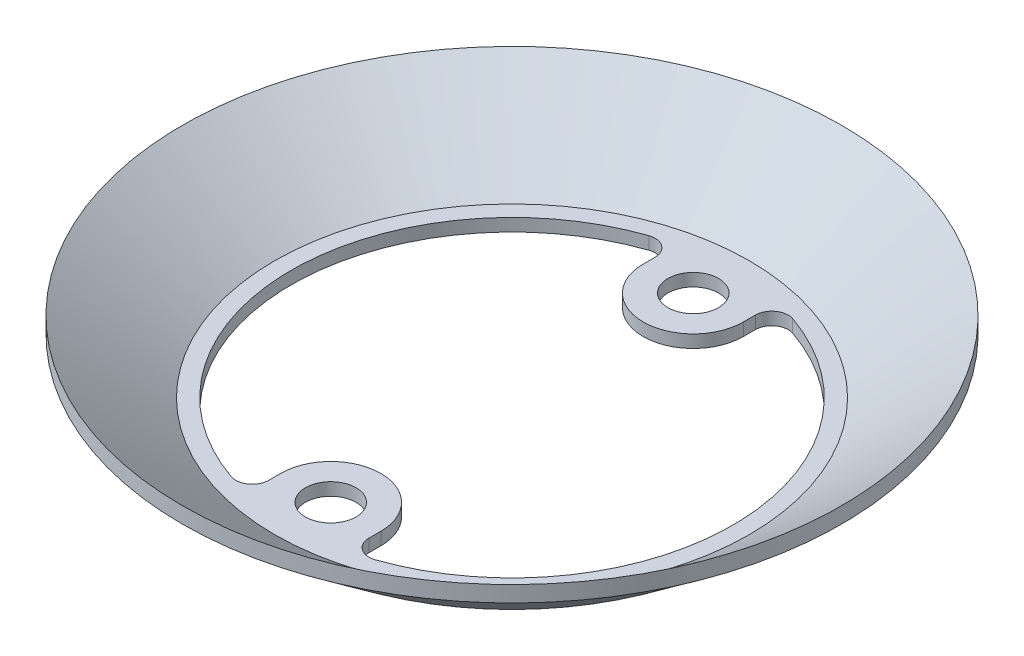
from build123d import *

# Parameters (mm, degrees)
SKETCH2_R           = 2.4384
BOSS_EXTRUDE1_DEPTH = 1.2192
FILLET1_R           = 1.5875


with BuildPart() as part:
    # Sketch1 → Revolve1 (revolve)
    with BuildSketch(Plane(origin=(0, 0, 0), x_dir=(0, 0, -1), z_dir=(1, 0, 0))):
        Polygon((31.75, 8.0772), (31.75, 6.537382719), (23.275614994, 0), (21.2725, 0), (21.2725, 1.2192), (22.86, 1.2192), align=None)
    revolve(axis=Axis((0, 0, 0), (0, 1, 0)))

    # Sketch2 → Boss-Extrude1 (add)
    with BuildSketch(Plane(origin=(0, 1.2192, 0), x_dir=(1, 0, 0), z_dir=(0, 1, 0))):
        with BuildLine():
            Line((-4.826, 17.4625), (-4.826, 21.973274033))
            Line((-4.826, 21.973274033), (4.826, 21.973274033))
            Line((4.826, 21.973274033), (4.826, 17.4625))
            ThreePointArc((4.826, 17.4625), (0, 12.6365), (-4.826, 17.4625))
        make_face()
        with Locations(Location((0, 17.4625, 0), (0, 0, 270))):
            Circle(SKETCH2_R, mode=Mode.SUBTRACT)
    boss_extrude1 = extrude(amount=-BOSS_EXTRUDE1_DEPTH)

    # Mirror1: Boss-Extrude1 across plane
    add(boss_extrude1.mirror(Plane.XY))

    # Fillet1
    fillet1_edges = [part.edges().sort_by_distance(p)[0] for p in [
        (-4.826, 0.6096, -20.717842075),
        (4.826, 0.6096, -20.717842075),
        (4.826, 0.6096, 20.717842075),
        (-4.826, 0.6096, 20.717842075),
    ]]
    fillet(fillet1_edges, radius=FILLET1_R)


solid = part.part
